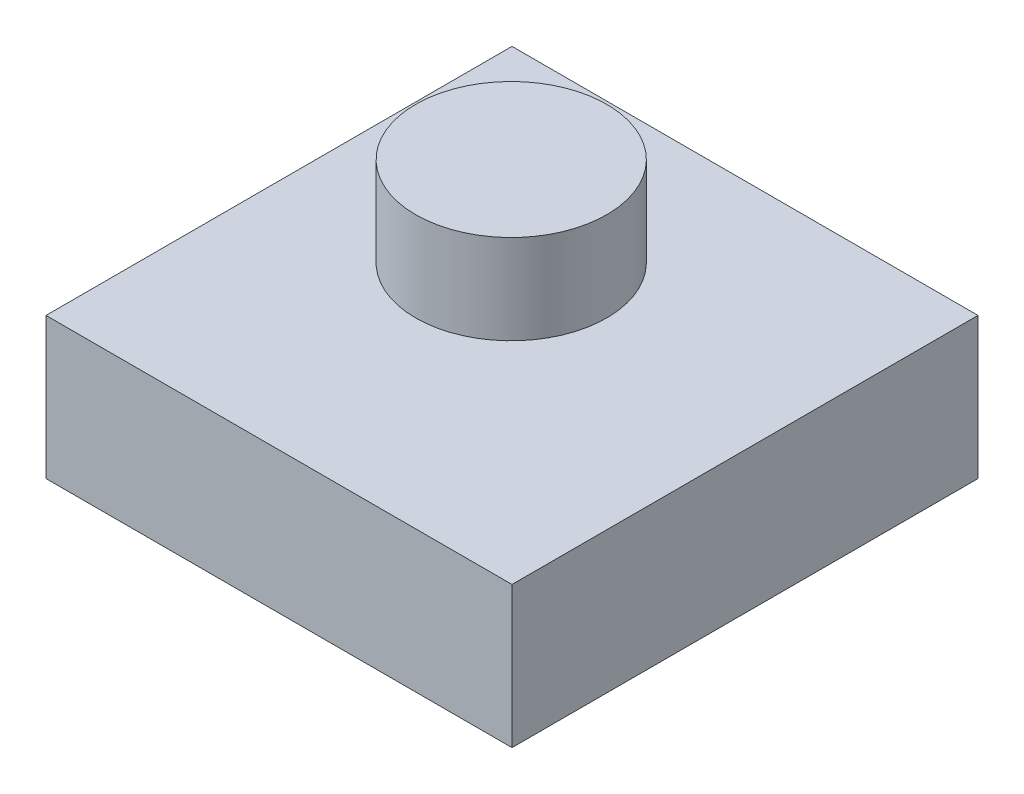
from build123d import *

# Parameters (mm, degrees)
SKETCH1_W      = 97.52724138
SKETCH1_H      = 97.52724138
EXTRUDE1_DEPTH = 29.577471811
SKETCH2_R      = 20
EXTRUDE2_DEPTH = 18.720014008


with BuildPart() as part:
    # Sketch1 → Extrude1 (new body)
    with BuildSketch(Plane(origin=(0, 0, 0), x_dir=(1, 0, 0), z_dir=(0, 1, 0))):
        Rectangle(SKETCH1_W, SKETCH1_H)
    extrude(amount=EXTRUDE1_DEPTH)

    # Sketch2 → Extrude2 (add)
    with BuildSketch(Plane(origin=(-1.333675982, 29.577471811, 0), x_dir=(-1, 0, 0), z_dir=(0, 1, 0))):
        with Locations(Location((8.283257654, -9.452987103, 0), (0, 0, 90))):
            Circle(SKETCH2_R)
    extrude(amount=EXTRUDE2_DEPTH)


solid = part.part
